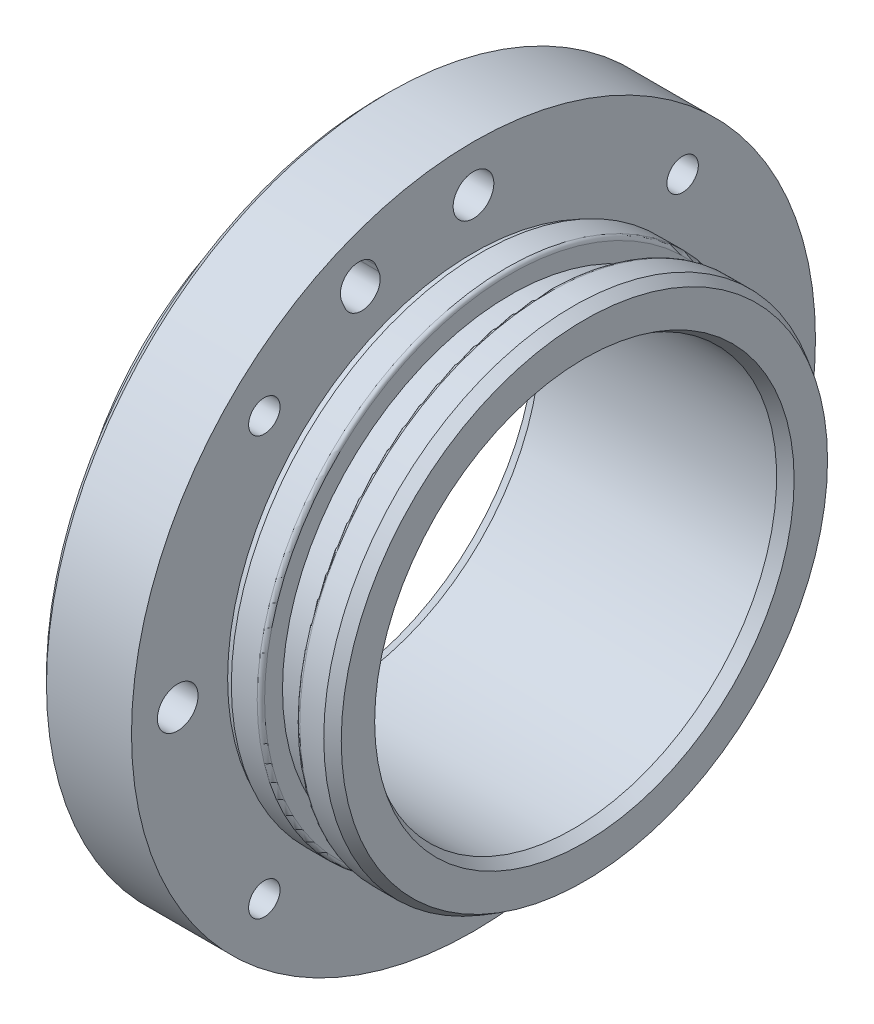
ISO-10303-21;
HEADER;
FILE_DESCRIPTION(('STEP AP214'),'2;1');
FILE_NAME('part.step','',(''),(''),'','','');
FILE_SCHEMA(('AUTOMOTIVE_DESIGN { 1 0 10303 214 1 1 1 1 }'));
ENDSEC;
DATA;
#1=APPLICATION_CONTEXT('core data for automotive mechanical design processes');
#2=APPLICATION_PROTOCOL_DEFINITION('international standard','automotive_design',2000,#1);
#3=PRODUCT_CONTEXT('',#1,'mechanical');
#4=PRODUCT('Part','Part','',(#3));
#5=PRODUCT_RELATED_PRODUCT_CATEGORY('part','',(#4));
#6=PRODUCT_DEFINITION_FORMATION('','',#4);
#7=PRODUCT_DEFINITION_CONTEXT('part definition',#1,'design');
#8=PRODUCT_DEFINITION('design','',#6,#7);
#9=PRODUCT_DEFINITION_SHAPE('','',#8);
#10=(LENGTH_UNIT() NAMED_UNIT(*) SI_UNIT(.MILLI.,.METRE.));
#11=(NAMED_UNIT(*) PLANE_ANGLE_UNIT() SI_UNIT($,.RADIAN.));
#12=(NAMED_UNIT(*) SI_UNIT($,.STERADIAN.) SOLID_ANGLE_UNIT());
#13=UNCERTAINTY_MEASURE_WITH_UNIT(LENGTH_MEASURE(1.E-05),#10,'distance_accuracy_value','');
#14=(GEOMETRIC_REPRESENTATION_CONTEXT(3) GLOBAL_UNCERTAINTY_ASSIGNED_CONTEXT((#13)) GLOBAL_UNIT_ASSIGNED_CONTEXT((#10,
#11,#12)) REPRESENTATION_CONTEXT('',''));
#15=CARTESIAN_POINT('',(0.,0.,0.));
#16=DIRECTION('',(0.,0.,1.));
#17=DIRECTION('',(1.,0.,0.));
#18=AXIS2_PLACEMENT_3D('',#15,#16,#17);
#19=CARTESIAN_POINT('',(-14.2354130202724,0.,0.));
#20=DIRECTION('',(-1.,0.,0.));
#21=DIRECTION('',(0.,0.,1.));
#22=AXIS2_PLACEMENT_3D('',#19,#20,#21);
#23=CYLINDRICAL_SURFACE('',#22,55.);
#24=CARTESIAN_POINT('',(-37.,0.,0.));
#25=DIRECTION('',(1.,0.,0.));
#26=DIRECTION('',(0.,0.,-1.));
#27=AXIS2_PLACEMENT_3D('',#24,#25,#26);
#28=CIRCLE('',#27,55.);
#29=CARTESIAN_POINT('',(-37.,0.,-55.));
#30=VERTEX_POINT('',#29);
#31=EDGE_CURVE('E601',#30,#30,#28,.F.);
#32=ORIENTED_EDGE('',*,*,#31,.T.);
#33=EDGE_LOOP('',(#32));
#34=FACE_BOUND('',#33,.T.);
#35=CARTESIAN_POINT('',(27.,0.,0.));
#36=DIRECTION('',(-1.,0.,0.));
#37=DIRECTION('',(0.,0.,1.));
#38=AXIS2_PLACEMENT_3D('',#35,#36,#37);
#39=CIRCLE('',#38,55.);
#40=CARTESIAN_POINT('',(27.,0.,55.));
#41=VERTEX_POINT('',#40);
#42=EDGE_CURVE('E568',#41,#41,#39,.F.);
#43=ORIENTED_EDGE('',*,*,#42,.T.);
#44=EDGE_LOOP('',(#43));
#45=FACE_BOUND('',#44,.T.);
#46=CARTESIAN_POINT('',(-12.5,24.126017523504,-49.4260586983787));
#47=CARTESIAN_POINT('',(-12.6893836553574,24.1260103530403,-49.4260631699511));
#48=CARTESIAN_POINT('',(-12.8789000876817,24.1116199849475,-49.4330945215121));
#49=CARTESIAN_POINT('',(-13.2527004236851,24.0543890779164,-49.4609678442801));
#50=CARTESIAN_POINT('',(-13.4369779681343,24.0115153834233,-49.4818259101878));
#51=CARTESIAN_POINT('',(-13.7948318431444,23.8984605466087,-49.5365269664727));
#52=CARTESIAN_POINT('',(-13.9684137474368,23.8282937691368,-49.5703631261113));
#53=CARTESIAN_POINT('',(-14.3000133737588,23.6625255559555,-49.6497058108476));
#54=CARTESIAN_POINT('',(-14.4580346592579,23.5669299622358,-49.695209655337));
#55=CARTESIAN_POINT('',(-14.7543027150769,23.3526892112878,-49.7962439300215));
#56=CARTESIAN_POINT('',(-14.8925238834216,23.2340146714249,-49.8517871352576));
#57=CARTESIAN_POINT('',(-15.1450490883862,22.9768533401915,-49.9708339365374));
#58=CARTESIAN_POINT('',(-15.2593521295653,22.8383657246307,-50.03433786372));
#59=CARTESIAN_POINT('',(-15.4608739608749,22.5451960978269,-50.1671207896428));
#60=CARTESIAN_POINT('',(-15.548071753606,22.3905016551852,-50.2364042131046));
#61=CARTESIAN_POINT('',(-15.6927733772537,22.0692375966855,-50.378364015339));
#62=CARTESIAN_POINT('',(-15.7502775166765,21.9026681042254,-50.4510403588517));
#63=CARTESIAN_POINT('',(-15.8338889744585,21.5624974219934,-50.597360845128));
#64=CARTESIAN_POINT('',(-15.8600361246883,21.3889054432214,-50.6710036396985));
#65=CARTESIAN_POINT('',(-15.8803143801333,21.0393794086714,-50.8171269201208));
#66=CARTESIAN_POINT('',(-15.8744458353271,20.8634453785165,-50.8896074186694));
#67=CARTESIAN_POINT('',(-15.8308921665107,20.5144910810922,-51.031275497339));
#68=CARTESIAN_POINT('',(-15.793249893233,20.3414672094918,-51.1004673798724));
#69=CARTESIAN_POINT('',(-15.6872837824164,20.0030674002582,-51.2338793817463));
#70=CARTESIAN_POINT('',(-15.61895976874,19.8376915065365,-51.2980994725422));
#71=CARTESIAN_POINT('',(-15.4535210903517,19.5192806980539,-51.4201011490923));
#72=CARTESIAN_POINT('',(-15.356386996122,19.3662542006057,-51.4778783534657));
#73=CARTESIAN_POINT('',(-15.1360995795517,19.0771483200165,-51.5857175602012));
#74=CARTESIAN_POINT('',(-15.0129459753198,18.9410691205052,-51.6357794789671));
#75=CARTESIAN_POINT('',(-14.743873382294,18.6896728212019,-51.7273051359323));
#76=CARTESIAN_POINT('',(-14.5979172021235,18.5743903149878,-51.7687545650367));
#77=CARTESIAN_POINT('',(-14.287512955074,18.3683181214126,-51.8422308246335));
#78=CARTESIAN_POINT('',(-14.123064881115,18.2775284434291,-51.8742576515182));
#79=CARTESIAN_POINT('',(-13.7803212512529,18.1231883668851,-51.9283811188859));
#80=CARTESIAN_POINT('',(-13.6020249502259,18.0596394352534,-51.9504772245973));
#81=CARTESIAN_POINT('',(-13.2366568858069,17.9617356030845,-51.9844088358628));
#82=CARTESIAN_POINT('',(-13.0495852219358,17.9273803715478,-51.9962444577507));
#83=CARTESIAN_POINT('',(-12.6723032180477,17.8889550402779,-52.0094771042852));
#84=CARTESIAN_POINT('',(-12.4820984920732,17.884835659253,-52.0108911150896));
#85=CARTESIAN_POINT('',(-12.1036625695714,17.9068789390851,-52.0033058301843));
#86=CARTESIAN_POINT('',(-11.9154313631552,17.9330414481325,-51.9943065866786));
#87=CARTESIAN_POINT('',(-11.546432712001,18.0148100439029,-51.9660318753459));
#88=CARTESIAN_POINT('',(-11.3656596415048,18.0703934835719,-51.9467643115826));
#89=CARTESIAN_POINT('',(-11.0165351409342,18.2092913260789,-51.8982378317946));
#90=CARTESIAN_POINT('',(-10.8481838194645,18.2926059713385,-51.8689788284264));
#91=CARTESIAN_POINT('',(-10.528442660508,18.4845705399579,-51.8008783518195));
#92=CARTESIAN_POINT('',(-10.3770750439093,18.5932530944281,-51.7620245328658));
#93=CARTESIAN_POINT('',(-10.0958218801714,18.8326362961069,-51.6754097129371));
#94=CARTESIAN_POINT('',(-9.96593653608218,18.9633371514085,-51.6276486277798));
#95=CARTESIAN_POINT('',(-9.73115923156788,19.2430671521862,-51.5240390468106));
#96=CARTESIAN_POINT('',(-9.62630093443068,19.3921205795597,-51.4681798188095));
#97=CARTESIAN_POINT('',(-9.44478460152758,19.7040225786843,-51.349579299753));
#98=CARTESIAN_POINT('',(-9.36812639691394,19.8668710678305,-51.2868380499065));
#99=CARTESIAN_POINT('',(-9.24524487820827,20.2014844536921,-51.1559600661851));
#100=CARTESIAN_POINT('',(-9.199000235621,20.3732430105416,-51.0878271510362));
#101=CARTESIAN_POINT('',(-9.13818875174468,20.7208069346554,-50.9478482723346));
#102=CARTESIAN_POINT('',(-9.12362161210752,20.8966122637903,-50.8760023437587));
#103=CARTESIAN_POINT('',(-9.12658152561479,21.2469423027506,-50.7306943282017));
#104=CARTESIAN_POINT('',(-9.1440558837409,21.4214686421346,-50.6572350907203));
#105=CARTESIAN_POINT('',(-9.21049353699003,21.764611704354,-50.5107562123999));
#106=CARTESIAN_POINT('',(-9.25945688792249,21.9332284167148,-50.4377365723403));
#107=CARTESIAN_POINT('',(-9.38747085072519,22.2598677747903,-50.2944343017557));
#108=CARTESIAN_POINT('',(-9.46652130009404,22.4178904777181,-50.2241516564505));
#109=CARTESIAN_POINT('',(-9.65245802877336,22.7190207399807,-50.0886553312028));
#110=CARTESIAN_POINT('',(-9.7593435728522,22.8621286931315,-50.0234415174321));
#111=CARTESIAN_POINT('',(-9.9981106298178,23.1297861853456,-49.9002481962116));
#112=CARTESIAN_POINT('',(-10.1300301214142,23.2543070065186,-49.8422799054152));
#113=CARTESIAN_POINT('',(-10.4150715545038,23.4812290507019,-49.7357782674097));
#114=CARTESIAN_POINT('',(-10.5681986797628,23.583624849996,-49.6872472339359));
#115=CARTESIAN_POINT('',(-10.8914782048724,23.7636453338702,-49.601402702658));
#116=CARTESIAN_POINT('',(-11.0616510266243,23.8412398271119,-49.5641028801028));
#117=CARTESIAN_POINT('',(-11.4139192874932,23.9693579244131,-49.502272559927));
#118=CARTESIAN_POINT('',(-11.5960004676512,24.0199132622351,-49.4777270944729));
#119=CARTESIAN_POINT('',(-11.8993311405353,24.0794768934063,-49.4487553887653));
#120=CARTESIAN_POINT('',(-12.0186194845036,24.0969085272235,-49.4402585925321));
#121=CARTESIAN_POINT('',(-12.2585872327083,24.1201811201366,-49.4289088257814));
#122=CARTESIAN_POINT('',(-12.3792666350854,24.1260220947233,-49.426055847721));
#123=CARTESIAN_POINT('',(-12.5,24.126017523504,-49.4260586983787));
#124=B_SPLINE_CURVE_WITH_KNOTS('',3,(#46,#47,#48,#49,#50,#51,#52,#53,#54,#55,#56,#57,#58,#59,
#60,#61,#62,#63,#64,#65,#66,#67,#68,#69,#70,#71,#72,#73,#74,#75,#76,#77,#78,#79,#80,#81,#82,#83,
#84,#85,#86,#87,#88,#89,#90,#91,#92,#93,#94,#95,#96,#97,#98,#99,#100,#101,#102,#103,#104,#105,
#106,#107,#108,#109,#110,#111,#112,#113,#114,#115,#116,#117,#118,#119,#120,#121,#122,#123),
.UNSPECIFIED.,.T.,.F.,(4,2,2,2,2,2,2,2,2,2,2,2,2,2,2,2,2,2,2,2,2,2,2,2,2,2,2,2,2,2,2,2,2,2,2,2,
2,2,4),(0.,0.567710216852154,1.13608242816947,1.70415589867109,2.27209897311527,
2.84076990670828,3.40946450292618,3.97859855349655,4.54772669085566,5.11613111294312,
5.68452932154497,6.25216219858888,6.81979833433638,7.38781815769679,7.95584413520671,
8.52480643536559,9.0937689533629,9.66276210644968,10.2317488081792,10.7998079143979,
11.3678641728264,11.9354837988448,12.50310838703,13.0714671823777,13.639831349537,
14.2089557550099,14.7780767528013,15.3467982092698,15.915514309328,16.4832959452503,
17.0510785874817,17.6188581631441,18.1866227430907,18.755255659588,19.3240278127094,
19.8934897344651,20.4622818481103,20.8242014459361,21.1861205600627),.UNSPECIFIED.);
#125=CARTESIAN_POINT('',(-12.5,24.126017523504,-49.4260586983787));
#126=VERTEX_POINT('',#125);
#127=EDGE_CURVE('E538',#126,#126,#124,.T.);
#128=ORIENTED_EDGE('',*,*,#127,.F.);
#129=EDGE_LOOP('',(#128));
#130=FACE_BOUND('',#129,.T.);
#131=ADVANCED_FACE('F450',(#34,#45,#130),#23,.F.);
#132=CARTESIAN_POINT('',(-14.2354130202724,0.,0.));
#133=DIRECTION('',(-1.,0.,0.));
#134=DIRECTION('',(0.,0.,1.));
#135=AXIS2_PLACEMENT_3D('',#132,#133,#134);
#136=CYLINDRICAL_SURFACE('',#135,92.5);
#137=CARTESIAN_POINT('',(-23.,0.,0.));
#138=DIRECTION('',(1.,0.,0.));
#139=DIRECTION('',(0.,0.,-1.));
#140=AXIS2_PLACEMENT_3D('',#137,#138,#139);
#141=CIRCLE('',#140,92.5);
#142=CARTESIAN_POINT('',(-23.,0.,-92.5));
#143=VERTEX_POINT('',#142);
#144=EDGE_CURVE('E609',#143,#143,#141,.T.);
#145=ORIENTED_EDGE('',*,*,#144,.T.);
#146=EDGE_LOOP('',(#145));
#147=FACE_BOUND('',#146,.T.);
#148=CARTESIAN_POINT('',(0.,0.,0.));
#149=DIRECTION('',(-1.,0.,0.));
#150=DIRECTION('',(0.,0.,1.));
#151=AXIS2_PLACEMENT_3D('',#148,#149,#150);
#152=CIRCLE('',#151,92.5);
#153=CARTESIAN_POINT('',(0.,0.,92.5));
#154=VERTEX_POINT('',#153);
#155=EDGE_CURVE('E647',#154,#154,#152,.T.);
#156=ORIENTED_EDGE('',*,*,#155,.T.);
#157=EDGE_LOOP('',(#156));
#158=FACE_BOUND('',#157,.T.);
#159=CARTESIAN_POINT('',(-12.5,38.4927408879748,-84.1103970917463));
#160=CARTESIAN_POINT('',(-12.3104924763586,38.492733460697,-84.1104010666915));
#161=CARTESIAN_POINT('',(-12.1208491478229,38.4781704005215,-84.1170699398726));
#162=CARTESIAN_POINT('',(-11.7467900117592,38.4202613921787,-84.143535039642));
#163=CARTESIAN_POINT('',(-11.5623806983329,38.3768811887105,-84.1633468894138));
#164=CARTESIAN_POINT('',(-11.2042626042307,38.2625229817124,-84.2153979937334));
#165=CARTESIAN_POINT('',(-11.0305485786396,38.1915586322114,-84.2476310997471));
#166=CARTESIAN_POINT('',(-10.6987108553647,38.023981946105,-84.3233965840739));
#167=CARTESIAN_POINT('',(-10.5405833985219,37.9273758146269,-84.3669262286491));
#168=CARTESIAN_POINT('',(-10.2442634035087,37.7110860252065,-84.4638265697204));
#169=CARTESIAN_POINT('',(-10.1060812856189,37.5913903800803,-84.5172023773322));
#170=CARTESIAN_POINT('',(-9.85366263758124,37.3322280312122,-84.6319962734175));
#171=CARTESIAN_POINT('',(-9.73942706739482,37.1927605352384,-84.69341468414));
#172=CARTESIAN_POINT('',(-9.53812240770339,36.8978626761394,-84.8223059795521));
#173=CARTESIAN_POINT('',(-9.45106040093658,36.7424281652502,-84.8897804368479));
#174=CARTESIAN_POINT('',(-9.30662000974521,36.4199449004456,-85.0286328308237));
#175=CARTESIAN_POINT('',(-9.24924147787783,36.2528962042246,-85.1000107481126));
#176=CARTESIAN_POINT('',(-9.16582149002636,35.9119408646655,-85.2444528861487));
#177=CARTESIAN_POINT('',(-9.13976597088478,35.7380373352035,-85.3175163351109));
#178=CARTESIAN_POINT('',(-9.1196882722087,35.3882122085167,-85.4632104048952));
#179=CARTESIAN_POINT('',(-9.12566593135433,35.2122906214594,-85.5358410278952));
#180=CARTESIAN_POINT('',(-9.16947312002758,34.8635184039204,-85.6785888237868));
#181=CARTESIAN_POINT('',(-9.20728748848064,34.6906663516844,-85.7487071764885));
#182=CARTESIAN_POINT('',(-9.31367121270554,34.3528949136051,-85.8845840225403));
#183=CARTESIAN_POINT('',(-9.38224065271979,34.1879755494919,-85.9503425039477));
#184=CARTESIAN_POINT('',(-9.54820545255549,33.8707815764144,-86.0758345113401));
#185=CARTESIAN_POINT('',(-9.64560774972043,33.7185100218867,-86.135566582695));
#186=CARTESIAN_POINT('',(-9.86646825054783,33.4310678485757,-86.2475363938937));
#187=CARTESIAN_POINT('',(-9.98992654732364,33.295897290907,-86.2997741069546));
#188=CARTESIAN_POINT('',(-10.2594803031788,33.046523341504,-86.3955739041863));
#189=CARTESIAN_POINT('',(-10.4055889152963,32.9323322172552,-86.4391309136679));
#190=CARTESIAN_POINT('',(-10.7162494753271,32.7283654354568,-86.5165651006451));
#191=CARTESIAN_POINT('',(-10.8808014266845,32.6385897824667,-86.550442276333));
#192=CARTESIAN_POINT('',(-11.2236852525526,32.4861023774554,-86.607793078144));
#193=CARTESIAN_POINT('',(-11.4020173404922,32.4233910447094,-86.6312665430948));
#194=CARTESIAN_POINT('',(-11.7673957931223,32.3268952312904,-86.6673209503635));
#195=CARTESIAN_POINT('',(-11.9544421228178,32.2931106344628,-86.6799019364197));
#196=CARTESIAN_POINT('',(-12.3318239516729,32.2554848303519,-86.6939104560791));
#197=CARTESIAN_POINT('',(-12.5221574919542,32.2516263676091,-86.6953444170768));
#198=CARTESIAN_POINT('',(-12.9008123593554,32.273922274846,-86.6870467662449));
#199=CARTESIAN_POINT('',(-13.0891336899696,32.3000765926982,-86.6773151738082));
#200=CARTESIAN_POINT('',(-13.4583669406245,32.3816084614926,-86.6468886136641));
#201=CARTESIAN_POINT('',(-13.6392808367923,32.4369781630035,-86.6261965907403));
#202=CARTESIAN_POINT('',(-13.9886244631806,32.5752942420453,-86.574278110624));
#203=CARTESIAN_POINT('',(-14.1570541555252,32.6582407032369,-86.5430516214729));
#204=CARTESIAN_POINT('',(-14.4767330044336,32.8493067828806,-86.4707085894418));
#205=CARTESIAN_POINT('',(-14.6279742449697,32.95743793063,-86.4295875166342));
#206=CARTESIAN_POINT('',(-14.9089034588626,33.1956774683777,-86.3383647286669));
#207=CARTESIAN_POINT('',(-15.0385913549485,33.3257859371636,-86.2882629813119));
#208=CARTESIAN_POINT('',(-15.2727940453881,33.6042473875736,-86.1801997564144));
#209=CARTESIAN_POINT('',(-15.3772969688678,33.7526089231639,-86.1222345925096));
#210=CARTESIAN_POINT('',(-15.5580821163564,34.0632165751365,-85.9998552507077));
#211=CARTESIAN_POINT('',(-15.6343644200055,34.2254626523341,-85.9354410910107));
#212=CARTESIAN_POINT('',(-15.7565221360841,34.5591091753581,-85.801807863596));
#213=CARTESIAN_POINT('',(-15.802405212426,34.7305073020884,-85.7325900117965));
#214=CARTESIAN_POINT('',(-15.8624871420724,35.0775739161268,-85.5911730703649));
#215=CARTESIAN_POINT('',(-15.8766860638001,35.253242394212,-85.5189739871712));
#216=CARTESIAN_POINT('',(-15.8729957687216,35.6037369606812,-85.3736486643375));
#217=CARTESIAN_POINT('',(-15.8551252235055,35.7785634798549,-85.300522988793));
#218=CARTESIAN_POINT('',(-15.7878417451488,36.1225353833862,-85.1554302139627));
#219=CARTESIAN_POINT('',(-15.7384287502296,36.2916807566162,-85.0834631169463));
#220=CARTESIAN_POINT('',(-15.6094661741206,36.6195509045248,-84.9428651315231));
#221=CARTESIAN_POINT('',(-15.5299161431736,36.7782755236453,-84.874234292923));
#222=CARTESIAN_POINT('',(-15.3429424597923,37.080884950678,-84.7424642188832));
#223=CARTESIAN_POINT('',(-15.2355197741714,37.2247702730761,-84.6793247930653));
#224=CARTESIAN_POINT('',(-14.9957891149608,37.4938041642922,-84.5605482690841));
#225=CARTESIAN_POINT('',(-14.8634693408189,37.6189437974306,-84.5049147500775));
#226=CARTESIAN_POINT('',(-14.5776856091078,37.8470008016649,-84.4030223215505));
#227=CARTESIAN_POINT('',(-14.4242164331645,37.9499126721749,-84.3567657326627));
#228=CARTESIAN_POINT('',(-14.1004140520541,38.1307266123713,-84.2751895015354));
#229=CARTESIAN_POINT('',(-13.930068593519,38.2086103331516,-84.2398778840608));
#230=CARTESIAN_POINT('',(-13.5775661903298,38.3370701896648,-84.1814948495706));
#231=CARTESIAN_POINT('',(-13.3954235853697,38.3876788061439,-84.1584088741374));
#232=CARTESIAN_POINT('',(-13.0934461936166,38.4468420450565,-84.131390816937));
#233=CARTESIAN_POINT('',(-12.9755704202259,38.464033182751,-84.1235300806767));
#234=CARTESIAN_POINT('',(-12.7384810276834,38.486984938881,-84.1130319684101));
#235=CARTESIAN_POINT('',(-12.6192674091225,38.4927455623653,-84.1103945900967));
#236=CARTESIAN_POINT('',(-12.5,38.4927408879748,-84.1103970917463));
#237=B_SPLINE_CURVE_WITH_KNOTS('',3,(#159,#160,#161,#162,#163,#164,#165,#166,#167,#168,#169,
#170,#171,#172,#173,#174,#175,#176,#177,#178,#179,#180,#181,#182,#183,#184,#185,#186,#187,#188,
#189,#190,#191,#192,#193,#194,#195,#196,#197,#198,#199,#200,#201,#202,#203,#204,#205,#206,#207,
#208,#209,#210,#211,#212,#213,#214,#215,#216,#217,#218,#219,#220,#221,#222,#223,#224,#225,#226,
#227,#228,#229,#230,#231,#232,#233,#234,#235,#236),.UNSPECIFIED.,.T.,.F.,(4,2,2,2,2,2,2,2,2,2,2,
2,2,2,2,2,2,2,2,2,2,2,2,2,2,2,2,2,2,2,2,2,2,2,2,2,2,2,4),(0.,0.568087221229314,1.13685094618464,
1.70533349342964,2.27367859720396,2.84231956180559,3.41098331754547,3.9797951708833,
4.54860419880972,5.11715775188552,5.68570844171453,6.2539885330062,6.8222701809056,
7.39068867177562,7.9591091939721,8.52786104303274,9.0966129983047,9.66537376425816,
10.2341322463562,10.8025627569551,11.3709922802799,11.9392691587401,12.5075477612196,
13.0760870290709,13.6446283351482,14.2134370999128,14.7822442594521,15.3509079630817,
15.9195704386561,16.4879019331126,17.0562345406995,17.6245756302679,18.1928970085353,
18.7614884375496,19.3302204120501,19.8993683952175,20.4678370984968,20.8253654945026,
21.1828937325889),.UNSPECIFIED.);
#238=CARTESIAN_POINT('',(-12.5,38.4927408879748,-84.1103970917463));
#239=VERTEX_POINT('',#238);
#240=EDGE_CURVE('E560',#239,#239,#237,.T.);
#241=ORIENTED_EDGE('',*,*,#240,.F.);
#242=EDGE_LOOP('',(#241));
#243=FACE_BOUND('',#242,.T.);
#244=ADVANCED_FACE('F571',(#147,#158,#243),#136,.T.);
#245=CARTESIAN_POINT('',(-14.2354130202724,0.,0.));
#246=DIRECTION('',(-1.,0.,0.));
#247=DIRECTION('',(0.,0.,1.));
#248=AXIS2_PLACEMENT_3D('',#245,#246,#247);
#249=CYLINDRICAL_SURFACE('',#248,67.5);
#250=CARTESIAN_POINT('',(9.,0.,0.));
#251=DIRECTION('',(1.,0.,0.));
#252=DIRECTION('',(0.,0.,-1.));
#253=AXIS2_PLACEMENT_3D('',#250,#251,#252);
#254=CIRCLE('',#253,67.5);
#255=CARTESIAN_POINT('',(9.,0.,-67.5));
#256=VERTEX_POINT('',#255);
#257=EDGE_CURVE('E458',#256,#256,#254,.F.);
#258=ORIENTED_EDGE('',*,*,#257,.T.);
#259=EDGE_LOOP('',(#258));
#260=FACE_BOUND('',#259,.T.);
#261=CARTESIAN_POINT('',(2.,0.,0.));
#262=DIRECTION('',(-1.,0.,0.));
#263=DIRECTION('',(0.,0.,1.));
#264=AXIS2_PLACEMENT_3D('',#261,#262,#263);
#265=CIRCLE('',#264,67.5);
#266=CARTESIAN_POINT('',(2.,0.,67.5));
#267=VERTEX_POINT('',#266);
#268=EDGE_CURVE('E546',#267,#267,#265,.T.);
#269=ORIENTED_EDGE('',*,*,#268,.F.);
#270=EDGE_LOOP('',(#269));
#271=FACE_BOUND('',#270,.T.);
#272=ADVANCED_FACE('F576',(#260,#271),#249,.T.);
#273=CARTESIAN_POINT('',(20.5,0.,0.));
#274=DIRECTION('',(-1.,0.,0.));
#275=DIRECTION('',(0.,0.,1.));
#276=AXIS2_PLACEMENT_3D('',#273,#274,#275);
#277=CIRCLE('',#276,67.5);
#278=CARTESIAN_POINT('',(20.5,0.,67.5));
#279=VERTEX_POINT('',#278);
#280=EDGE_CURVE('E758',#279,#279,#277,.F.);
#281=ORIENTED_EDGE('',*,*,#280,.T.);
#282=EDGE_LOOP('',(#281));
#283=FACE_BOUND('',#282,.T.);
#284=CARTESIAN_POINT('',(27.,0.,0.));
#285=DIRECTION('',(-1.,0.,0.));
#286=DIRECTION('',(0.,0.,1.));
#287=AXIS2_PLACEMENT_3D('',#284,#285,#286);
#288=CIRCLE('',#287,67.5);
#289=CARTESIAN_POINT('',(27.,0.,67.5));
#290=VERTEX_POINT('',#289);
#291=EDGE_CURVE('E640',#290,#290,#288,.T.);
#292=ORIENTED_EDGE('',*,*,#291,.T.);
#293=EDGE_LOOP('',(#292));
#294=FACE_BOUND('',#293,.T.);
#295=ADVANCED_FACE('F583',(#283,#294),#249,.T.);
#296=CARTESIAN_POINT('',(30.,55.,0.));
#297=DIRECTION('',(-1.,0.,0.));
#298=DIRECTION('',(0.,0.,1.));
#299=AXIS2_PLACEMENT_3D('',#296,#297,#298);
#300=PLANE('',#299);
#301=CARTESIAN_POINT('',(30.,0.,0.));
#302=DIRECTION('',(-1.,0.,0.));
#303=DIRECTION('',(0.,0.,1.));
#304=AXIS2_PLACEMENT_3D('',#301,#302,#303);
#305=CIRCLE('',#304,56.7320508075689);
#306=CARTESIAN_POINT('',(30.,0.,56.7320508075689));
#307=VERTEX_POINT('',#306);
#308=EDGE_CURVE('E608',#307,#307,#305,.T.);
#309=ORIENTED_EDGE('',*,*,#308,.T.);
#310=EDGE_LOOP('',(#309));
#311=FACE_BOUND('',#310,.T.);
#312=CARTESIAN_POINT('',(30.,0.,0.));
#313=DIRECTION('',(-1.,0.,0.));
#314=DIRECTION('',(0.,0.,1.));
#315=AXIS2_PLACEMENT_3D('',#312,#313,#314);
#316=CIRCLE('',#315,65.7679491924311);
#317=CARTESIAN_POINT('',(30.,0.,65.7679491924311));
#318=VERTEX_POINT('',#317);
#319=EDGE_CURVE('E637',#318,#318,#316,.F.);
#320=ORIENTED_EDGE('',*,*,#319,.T.);
#321=EDGE_LOOP('',(#320));
#322=FACE_BOUND('',#321,.T.);
#323=ADVANCED_FACE('F582',(#311,#322),#300,.F.);
#324=CARTESIAN_POINT('',(0.,67.5,0.));
#325=DIRECTION('',(-1.,0.,0.));
#326=DIRECTION('',(0.,0.,1.));
#327=AXIS2_PLACEMENT_3D('',#324,#325,#326);
#328=PLANE('',#327);
#329=DIRECTION('',(0.,0.923879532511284,0.382683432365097));
#330=VECTOR('',#329,1.);
#331=CARTESIAN_POINT('',(0.,74.8999002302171,25.6125934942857));
#332=LINE('',#331,#330);
#333=CARTESIAN_POINT('',(0.,74.8999002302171,25.6125934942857));
#334=VERTEX_POINT('',#333);
#335=CARTESIAN_POINT('',(0.,76.7476592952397,26.3779603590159));
#336=VERTEX_POINT('',#335);
#337=EDGE_CURVE('E515',#334,#336,#332,.T.);
#338=ORIENTED_EDGE('',*,*,#337,.F.);
#339=CARTESIAN_POINT('',(0.,72.9864830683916,30.2319911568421));
#340=DIRECTION('',(1.,0.,0.));
#341=DIRECTION('',(0.,0.,-1.));
#342=AXIS2_PLACEMENT_3D('',#339,#340,#341);
#343=CIRCLE('',#342,5.00000000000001);
#344=CARTESIAN_POINT('',(0.,71.0730659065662,34.8513888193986));
#345=VERTEX_POINT('',#344);
#346=EDGE_CURVE('E465',#345,#334,#343,.T.);
#347=ORIENTED_EDGE('',*,*,#346,.F.);
#348=DIRECTION('',(0.,-0.923879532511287,-0.38268343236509));
#349=VECTOR('',#348,1.);
#350=CARTESIAN_POINT('',(0.,71.0730659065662,34.8513888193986));
#351=LINE('',#350,#349);
#352=CARTESIAN_POINT('',(0.,72.9208249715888,35.6167556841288));
#353=VERTEX_POINT('',#352);
#354=EDGE_CURVE('E522',#353,#345,#351,.T.);
#355=ORIENTED_EDGE('',*,*,#354,.F.);
#356=CARTESIAN_POINT('',(0.,74.8342421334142,30.9973580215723));
#357=DIRECTION('',(1.,0.,0.));
#358=DIRECTION('',(0.,0.,-1.));
#359=AXIS2_PLACEMENT_3D('',#356,#357,#358);
#360=CIRCLE('',#359,5.);
#361=EDGE_CURVE('E504',#336,#353,#360,.T.);
#362=ORIENTED_EDGE('',*,*,#361,.F.);
#363=EDGE_LOOP('',(#338,#347,#355,#362));
#364=FACE_BOUND('',#363,.T.);
#365=CARTESIAN_POINT('',(0.,-56.5685424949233,-56.5685424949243));
#366=DIRECTION('',(-1.,0.,0.));
#367=DIRECTION('',(0.,0.,1.));
#368=AXIS2_PLACEMENT_3D('',#365,#366,#367);
#369=CIRCLE('',#368,4.24999999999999);
#370=CARTESIAN_POINT('',(0.,-56.5685424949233,-52.3185424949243));
#371=VERTEX_POINT('',#370);
#372=EDGE_CURVE('E708',#371,#371,#369,.T.);
#373=ORIENTED_EDGE('',*,*,#372,.T.);
#374=EDGE_LOOP('',(#373));
#375=FACE_BOUND('',#374,.T.);
#376=CARTESIAN_POINT('',(0.,-56.5685424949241,56.5685424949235));
#377=DIRECTION('',(-1.,0.,0.));
#378=DIRECTION('',(0.,0.,1.));
#379=AXIS2_PLACEMENT_3D('',#376,#377,#378);
#380=CIRCLE('',#379,4.24999999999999);
#381=CARTESIAN_POINT('',(0.,-56.5685424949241,60.8185424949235));
#382=VERTEX_POINT('',#381);
#383=EDGE_CURVE('E702',#382,#382,#380,.T.);
#384=ORIENTED_EDGE('',*,*,#383,.T.);
#385=EDGE_LOOP('',(#384));
#386=FACE_BOUND('',#385,.T.);
#387=CARTESIAN_POINT('',(0.,56.5685424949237,56.5685424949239));
#388=DIRECTION('',(-1.,0.,0.));
#389=DIRECTION('',(0.,0.,1.));
#390=AXIS2_PLACEMENT_3D('',#387,#388,#389);
#391=CIRCLE('',#390,4.24999999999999);
#392=CARTESIAN_POINT('',(0.,56.5685424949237,60.8185424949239));
#393=VERTEX_POINT('',#392);
#394=EDGE_CURVE('E696',#393,#393,#391,.T.);
#395=ORIENTED_EDGE('',*,*,#394,.T.);
#396=EDGE_LOOP('',(#395));
#397=FACE_BOUND('',#396,.T.);
#398=CARTESIAN_POINT('',(0.,8.37956006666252E-13,-80.));
#399=DIRECTION('',(-1.,0.,0.));
#400=DIRECTION('',(0.,0.,1.));
#401=AXIS2_PLACEMENT_3D('',#398,#399,#400);
#402=CIRCLE('',#401,5.49999999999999);
#403=CARTESIAN_POINT('',(0.,8.37956006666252E-13,-74.5));
#404=VERTEX_POINT('',#403);
#405=EDGE_CURVE('E615',#404,#404,#402,.T.);
#406=ORIENTED_EDGE('',*,*,#405,.T.);
#407=EDGE_LOOP('',(#406));
#408=FACE_BOUND('',#407,.T.);
#409=CARTESIAN_POINT('',(0.,-80.,-5.58637337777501E-13));
#410=DIRECTION('',(-1.,0.,0.));
#411=DIRECTION('',(0.,0.,1.));
#412=AXIS2_PLACEMENT_3D('',#409,#410,#411);
#413=CIRCLE('',#412,5.5);
#414=CARTESIAN_POINT('',(0.,-80.,5.49999999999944));
#415=VERTEX_POINT('',#414);
#416=EDGE_CURVE('E620',#415,#415,#413,.T.);
#417=ORIENTED_EDGE('',*,*,#416,.T.);
#418=EDGE_LOOP('',(#417));
#419=FACE_BOUND('',#418,.T.);
#420=CARTESIAN_POINT('',(0.,-2.79318668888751E-13,80.));
#421=DIRECTION('',(-1.,0.,0.));
#422=DIRECTION('',(0.,0.,1.));
#423=AXIS2_PLACEMENT_3D('',#420,#421,#422);
#424=CIRCLE('',#423,5.49999999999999);
#425=CARTESIAN_POINT('',(0.,-2.79318668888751E-13,85.5));
#426=VERTEX_POINT('',#425);
#427=EDGE_CURVE('E625',#426,#426,#424,.T.);
#428=ORIENTED_EDGE('',*,*,#427,.T.);
#429=EDGE_LOOP('',(#428));
#430=FACE_BOUND('',#429,.T.);
#431=CARTESIAN_POINT('',(0.,56.5685424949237,-56.5685424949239));
#432=DIRECTION('',(-1.,0.,0.));
#433=DIRECTION('',(0.,0.,1.));
#434=AXIS2_PLACEMENT_3D('',#431,#432,#433);
#435=CIRCLE('',#434,4.24999999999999);
#436=CARTESIAN_POINT('',(0.,56.5685424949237,-52.3185424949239));
#437=VERTEX_POINT('',#436);
#438=EDGE_CURVE('E663',#437,#437,#435,.T.);
#439=ORIENTED_EDGE('',*,*,#438,.T.);
#440=EDGE_LOOP('',(#439));
#441=FACE_BOUND('',#440,.T.);
#442=CARTESIAN_POINT('',(0.,80.,0.));
#443=DIRECTION('',(-1.,0.,0.));
#444=DIRECTION('',(0.,0.,1.));
#445=AXIS2_PLACEMENT_3D('',#442,#443,#444);
#446=CIRCLE('',#445,5.5);
#447=CARTESIAN_POINT('',(0.,80.,5.5));
#448=VERTEX_POINT('',#447);
#449=EDGE_CURVE('E630',#448,#448,#446,.T.);
#450=ORIENTED_EDGE('',*,*,#449,.T.);
#451=EDGE_LOOP('',(#450));
#452=FACE_BOUND('',#451,.T.);
#453=ORIENTED_EDGE('',*,*,#155,.F.);
#454=EDGE_LOOP('',(#453));
#455=FACE_BOUND('',#454,.T.);
#456=CARTESIAN_POINT('',(0.,0.,0.));
#457=DIRECTION('',(-1.,0.,0.));
#458=DIRECTION('',(0.,0.,1.));
#459=AXIS2_PLACEMENT_3D('',#456,#457,#458);
#460=CIRCLE('',#459,66.5);
#461=CARTESIAN_POINT('',(0.,0.,66.5));
#462=VERTEX_POINT('',#461);
#463=EDGE_CURVE('E738',#462,#462,#460,.T.);
#464=ORIENTED_EDGE('',*,*,#463,.T.);
#465=EDGE_LOOP('',(#464));
#466=FACE_BOUND('',#465,.T.);
#467=ADVANCED_FACE('F519',(#364,#375,#386,#397,#408,#419,#430,#441,#452,#455,#466),#328,.F.);
#468=CARTESIAN_POINT('',(-25.,92.5,0.));
#469=DIRECTION('',(1.,0.,0.));
#470=DIRECTION('',(0.,0.,-1.));
#471=AXIS2_PLACEMENT_3D('',#468,#469,#470);
#472=PLANE('',#471);
#473=CARTESIAN_POINT('',(-25.,-56.5685424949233,-56.5685424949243));
#474=DIRECTION('',(-1.,0.,0.));
#475=DIRECTION('',(0.,0.,1.));
#476=AXIS2_PLACEMENT_3D('',#473,#474,#475);
#477=CIRCLE('',#476,4.24999999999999);
#478=CARTESIAN_POINT('',(-25.,-56.5685424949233,-52.3185424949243));
#479=VERTEX_POINT('',#478);
#480=EDGE_CURVE('E711',#479,#479,#477,.T.);
#481=ORIENTED_EDGE('',*,*,#480,.F.);
#482=EDGE_LOOP('',(#481));
#483=FACE_BOUND('',#482,.T.);
#484=CARTESIAN_POINT('',(-25.,-56.5685424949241,56.5685424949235));
#485=DIRECTION('',(-1.,0.,0.));
#486=DIRECTION('',(0.,0.,1.));
#487=AXIS2_PLACEMENT_3D('',#484,#485,#486);
#488=CIRCLE('',#487,4.24999999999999);
#489=CARTESIAN_POINT('',(-25.,-56.5685424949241,60.8185424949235));
#490=VERTEX_POINT('',#489);
#491=EDGE_CURVE('E705',#490,#490,#488,.T.);
#492=ORIENTED_EDGE('',*,*,#491,.F.);
#493=EDGE_LOOP('',(#492));
#494=FACE_BOUND('',#493,.T.);
#495=CARTESIAN_POINT('',(-25.,56.5685424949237,56.5685424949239));
#496=DIRECTION('',(-1.,0.,0.));
#497=DIRECTION('',(0.,0.,1.));
#498=AXIS2_PLACEMENT_3D('',#495,#496,#497);
#499=CIRCLE('',#498,4.24999999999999);
#500=CARTESIAN_POINT('',(-25.,56.5685424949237,60.8185424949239));
#501=VERTEX_POINT('',#500);
#502=EDGE_CURVE('E699',#501,#501,#499,.T.);
#503=ORIENTED_EDGE('',*,*,#502,.F.);
#504=EDGE_LOOP('',(#503));
#505=FACE_BOUND('',#504,.T.);
#506=CARTESIAN_POINT('',(-25.,8.37956006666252E-13,-80.));
#507=DIRECTION('',(-1.,0.,0.));
#508=DIRECTION('',(0.,0.,1.));
#509=AXIS2_PLACEMENT_3D('',#506,#507,#508);
#510=CIRCLE('',#509,8.5);
#511=CARTESIAN_POINT('',(-25.,8.37956006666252E-13,-71.5));
#512=VERTEX_POINT('',#511);
#513=EDGE_CURVE('E619',#512,#512,#510,.T.);
#514=ORIENTED_EDGE('',*,*,#513,.F.);
#515=EDGE_LOOP('',(#514));
#516=FACE_BOUND('',#515,.T.);
#517=CARTESIAN_POINT('',(-25.,-80.,-5.58637337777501E-13));
#518=DIRECTION('',(-1.,0.,0.));
#519=DIRECTION('',(0.,0.,1.));
#520=AXIS2_PLACEMENT_3D('',#517,#518,#519);
#521=CIRCLE('',#520,8.49999999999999);
#522=CARTESIAN_POINT('',(-25.,-80.,8.49999999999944));
#523=VERTEX_POINT('',#522);
#524=EDGE_CURVE('E624',#523,#523,#521,.T.);
#525=ORIENTED_EDGE('',*,*,#524,.F.);
#526=EDGE_LOOP('',(#525));
#527=FACE_BOUND('',#526,.T.);
#528=CARTESIAN_POINT('',(-25.,-2.79318668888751E-13,80.));
#529=DIRECTION('',(-1.,0.,0.));
#530=DIRECTION('',(0.,0.,1.));
#531=AXIS2_PLACEMENT_3D('',#528,#529,#530);
#532=CIRCLE('',#531,8.5);
#533=CARTESIAN_POINT('',(-25.,-2.79318668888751E-13,88.5));
#534=VERTEX_POINT('',#533);
#535=EDGE_CURVE('E629',#534,#534,#532,.T.);
#536=ORIENTED_EDGE('',*,*,#535,.F.);
#537=EDGE_LOOP('',(#536));
#538=FACE_BOUND('',#537,.T.);
#539=CARTESIAN_POINT('',(-25.,56.5685424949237,-56.5685424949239));
#540=DIRECTION('',(-1.,0.,0.));
#541=DIRECTION('',(0.,0.,1.));
#542=AXIS2_PLACEMENT_3D('',#539,#540,#541);
#543=CIRCLE('',#542,4.24999999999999);
#544=CARTESIAN_POINT('',(-25.,56.5685424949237,-52.3185424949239));
#545=VERTEX_POINT('',#544);
#546=EDGE_CURVE('E666',#545,#545,#543,.T.);
#547=ORIENTED_EDGE('',*,*,#546,.F.);
#548=EDGE_LOOP('',(#547));
#549=FACE_BOUND('',#548,.T.);
#550=CARTESIAN_POINT('',(-25.,80.,0.));
#551=DIRECTION('',(-1.,0.,0.));
#552=DIRECTION('',(0.,0.,1.));
#553=AXIS2_PLACEMENT_3D('',#550,#551,#552);
#554=CIRCLE('',#553,8.49999999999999);
#555=CARTESIAN_POINT('',(-25.,80.,8.49999999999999));
#556=VERTEX_POINT('',#555);
#557=EDGE_CURVE('E633',#556,#556,#554,.T.);
#558=ORIENTED_EDGE('',*,*,#557,.F.);
#559=EDGE_LOOP('',(#558));
#560=FACE_BOUND('',#559,.T.);
#561=CARTESIAN_POINT('',(-25.,0.,0.));
#562=DIRECTION('',(1.,0.,0.));
#563=DIRECTION('',(0.,0.,-1.));
#564=AXIS2_PLACEMENT_3D('',#561,#562,#563);
#565=CIRCLE('',#564,90.5);
#566=CARTESIAN_POINT('',(-25.,0.,-90.5));
#567=VERTEX_POINT('',#566);
#568=EDGE_CURVE('E612',#567,#567,#565,.F.);
#569=ORIENTED_EDGE('',*,*,#568,.T.);
#570=EDGE_LOOP('',(#569));
#571=FACE_BOUND('',#570,.T.);
#572=CARTESIAN_POINT('',(-25.,0.,0.));
#573=DIRECTION('',(-1.,0.,0.));
#574=DIRECTION('',(0.,0.,1.));
#575=AXIS2_PLACEMENT_3D('',#572,#573,#574);
#576=CIRCLE('',#575,70.);
#577=CARTESIAN_POINT('',(-25.,0.,70.));
#578=VERTEX_POINT('',#577);
#579=EDGE_CURVE('E650',#578,#578,#576,.T.);
#580=ORIENTED_EDGE('',*,*,#579,.F.);
#581=EDGE_LOOP('',(#580));
#582=FACE_BOUND('',#581,.T.);
#583=ADVANCED_FACE('F578',(#483,#494,#505,#516,#527,#538,#549,#560,#571,#582),#472,.F.);
#584=CARTESIAN_POINT('',(-14.2354130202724,0.,0.));
#585=DIRECTION('',(-1.,0.,0.));
#586=DIRECTION('',(0.,0.,1.));
#587=AXIS2_PLACEMENT_3D('',#584,#585,#586);
#588=CYLINDRICAL_SURFACE('',#587,70.);
#589=CARTESIAN_POINT('',(-40.,0.,0.));
#590=DIRECTION('',(-1.,0.,0.));
#591=DIRECTION('',(0.,0.,1.));
#592=AXIS2_PLACEMENT_3D('',#589,#590,#591);
#593=CIRCLE('',#592,70.);
#594=CARTESIAN_POINT('',(-40.,0.,70.));
#595=VERTEX_POINT('',#594);
#596=EDGE_CURVE('E632',#595,#595,#593,.T.);
#597=ORIENTED_EDGE('',*,*,#596,.F.);
#598=EDGE_LOOP('',(#597));
#599=FACE_BOUND('',#598,.T.);
#600=ORIENTED_EDGE('',*,*,#579,.T.);
#601=EDGE_LOOP('',(#600));
#602=FACE_BOUND('',#601,.T.);
#603=ADVANCED_FACE('F1099',(#599,#602),#588,.T.);
#604=CARTESIAN_POINT('',(-40.,70.,0.));
#605=DIRECTION('',(1.,0.,0.));
#606=DIRECTION('',(0.,0.,-1.));
#607=AXIS2_PLACEMENT_3D('',#604,#605,#606);
#608=PLANE('',#607);
#609=CARTESIAN_POINT('',(-40.,6.54653130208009E-13,-62.5));
#610=DIRECTION('',(-1.,0.,0.));
#611=DIRECTION('',(0.,0.,1.));
#612=AXIS2_PLACEMENT_3D('',#609,#610,#611);
#613=CIRCLE('',#612,3.4);
#614=CARTESIAN_POINT('',(-40.,6.54653130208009E-13,-59.1));
#615=VERTEX_POINT('',#614);
#616=EDGE_CURVE('E726',#615,#615,#613,.T.);
#617=ORIENTED_EDGE('',*,*,#616,.F.);
#618=EDGE_LOOP('',(#617));
#619=FACE_BOUND('',#618,.T.);
#620=CARTESIAN_POINT('',(-40.,-62.5,-4.36435420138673E-13));
#621=DIRECTION('',(-1.,0.,0.));
#622=DIRECTION('',(0.,0.,1.));
#623=AXIS2_PLACEMENT_3D('',#620,#621,#622);
#624=CIRCLE('',#623,3.4);
#625=CARTESIAN_POINT('',(-40.,-62.5,3.39999999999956));
#626=VERTEX_POINT('',#625);
#627=EDGE_CURVE('E720',#626,#626,#624,.T.);
#628=ORIENTED_EDGE('',*,*,#627,.F.);
#629=EDGE_LOOP('',(#628));
#630=FACE_BOUND('',#629,.T.);
#631=CARTESIAN_POINT('',(-40.,-2.18217710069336E-13,62.5));
#632=DIRECTION('',(-1.,0.,0.));
#633=DIRECTION('',(0.,0.,1.));
#634=AXIS2_PLACEMENT_3D('',#631,#632,#633);
#635=CIRCLE('',#634,3.4);
#636=CARTESIAN_POINT('',(-40.,-2.18217710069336E-13,65.9));
#637=VERTEX_POINT('',#636);
#638=EDGE_CURVE('E714',#637,#637,#635,.T.);
#639=ORIENTED_EDGE('',*,*,#638,.F.);
#640=EDGE_LOOP('',(#639));
#641=FACE_BOUND('',#640,.T.);
#642=CARTESIAN_POINT('',(-40.,62.5,0.));
#643=DIRECTION('',(-1.,0.,0.));
#644=DIRECTION('',(0.,0.,1.));
#645=AXIS2_PLACEMENT_3D('',#642,#643,#644);
#646=CIRCLE('',#645,3.4);
#647=CARTESIAN_POINT('',(-40.,62.5,3.4));
#648=VERTEX_POINT('',#647);
#649=EDGE_CURVE('E669',#648,#648,#646,.T.);
#650=ORIENTED_EDGE('',*,*,#649,.F.);
#651=EDGE_LOOP('',(#650));
#652=FACE_BOUND('',#651,.T.);
#653=CARTESIAN_POINT('',(-40.,0.,0.));
#654=DIRECTION('',(1.,0.,0.));
#655=DIRECTION('',(0.,0.,-1.));
#656=AXIS2_PLACEMENT_3D('',#653,#654,#655);
#657=CIRCLE('',#656,56.7320508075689);
#658=CARTESIAN_POINT('',(-40.,0.,-56.7320508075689));
#659=VERTEX_POINT('',#658);
#660=EDGE_CURVE('E643',#659,#659,#657,.T.);
#661=ORIENTED_EDGE('',*,*,#660,.T.);
#662=EDGE_LOOP('',(#661));
#663=FACE_BOUND('',#662,.T.);
#664=ORIENTED_EDGE('',*,*,#596,.T.);
#665=EDGE_LOOP('',(#664));
#666=FACE_BOUND('',#665,.T.);
#667=ADVANCED_FACE('F1091',(#619,#630,#641,#652,#663,#666),#608,.F.);
#668=CARTESIAN_POINT('',(-37.,0.,0.));
#669=DIRECTION('',(-1.,0.,0.));
#670=DIRECTION('',(0.,0.,1.));
#671=AXIS2_PLACEMENT_3D('',#668,#669,#670);
#672=CONICAL_SURFACE('',#671,55.,0.523598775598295);
#673=ORIENTED_EDGE('',*,*,#660,.F.);
#674=EDGE_LOOP('',(#673));
#675=FACE_BOUND('',#674,.T.);
#676=ORIENTED_EDGE('',*,*,#31,.F.);
#677=EDGE_LOOP('',(#676));
#678=FACE_BOUND('',#677,.T.);
#679=ADVANCED_FACE('F1083',(#675,#678),#672,.F.);
#680=CARTESIAN_POINT('',(27.,0.,0.));
#681=DIRECTION('',(-1.,0.,0.));
#682=DIRECTION('',(0.,0.,1.));
#683=AXIS2_PLACEMENT_3D('',#680,#681,#682);
#684=CONICAL_SURFACE('',#683,67.5,0.523598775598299);
#685=ORIENTED_EDGE('',*,*,#319,.F.);
#686=EDGE_LOOP('',(#685));
#687=FACE_BOUND('',#686,.T.);
#688=ORIENTED_EDGE('',*,*,#291,.F.);
#689=EDGE_LOOP('',(#688));
#690=FACE_BOUND('',#689,.T.);
#691=ADVANCED_FACE('F1075',(#687,#690),#684,.T.);
#692=CARTESIAN_POINT('',(-25.,0.,0.));
#693=DIRECTION('',(1.,0.,0.));
#694=DIRECTION('',(0.,0.,-1.));
#695=AXIS2_PLACEMENT_3D('',#692,#693,#694);
#696=CONICAL_SURFACE('',#695,90.5,0.785398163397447);
#697=ORIENTED_EDGE('',*,*,#144,.F.);
#698=EDGE_LOOP('',(#697));
#699=FACE_BOUND('',#698,.T.);
#700=ORIENTED_EDGE('',*,*,#568,.F.);
#701=EDGE_LOOP('',(#700));
#702=FACE_BOUND('',#701,.T.);
#703=ADVANCED_FACE('F1067',(#699,#702),#696,.T.);
#704=CARTESIAN_POINT('',(-25.,80.,0.));
#705=DIRECTION('',(-1.,0.,0.));
#706=DIRECTION('',(0.,0.,1.));
#707=AXIS2_PLACEMENT_3D('',#704,#705,#706);
#708=CYLINDRICAL_SURFACE('',#707,5.5);
#709=CARTESIAN_POINT('',(-14.,80.,0.));
#710=DIRECTION('',(-1.,0.,0.));
#711=DIRECTION('',(0.,0.,1.));
#712=AXIS2_PLACEMENT_3D('',#709,#710,#711);
#713=CIRCLE('',#712,5.50000000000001);
#714=CARTESIAN_POINT('',(-14.,80.,5.50000000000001));
#715=VERTEX_POINT('',#714);
#716=EDGE_CURVE('E660',#715,#715,#713,.T.);
#717=ORIENTED_EDGE('',*,*,#716,.T.);
#718=EDGE_LOOP('',(#717));
#719=FACE_BOUND('',#718,.T.);
#720=ORIENTED_EDGE('',*,*,#449,.F.);
#721=EDGE_LOOP('',(#720));
#722=FACE_BOUND('',#721,.T.);
#723=ADVANCED_FACE('F1059',(#719,#722),#708,.F.);
#724=CARTESIAN_POINT('',(-25.,80.,0.));
#725=DIRECTION('',(-1.,0.,0.));
#726=DIRECTION('',(0.,0.,1.));
#727=AXIS2_PLACEMENT_3D('',#724,#725,#726);
#728=CYLINDRICAL_SURFACE('',#727,8.49999999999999);
#729=CARTESIAN_POINT('',(-14.,80.,0.));
#730=DIRECTION('',(-1.,0.,0.));
#731=DIRECTION('',(0.,0.,1.));
#732=AXIS2_PLACEMENT_3D('',#729,#730,#731);
#733=CIRCLE('',#732,8.49999999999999);
#734=CARTESIAN_POINT('',(-14.,80.,8.49999999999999));
#735=VERTEX_POINT('',#734);
#736=EDGE_CURVE('E657',#735,#735,#733,.T.);
#737=ORIENTED_EDGE('',*,*,#736,.F.);
#738=EDGE_LOOP('',(#737));
#739=FACE_BOUND('',#738,.T.);
#740=ORIENTED_EDGE('',*,*,#557,.T.);
#741=EDGE_LOOP('',(#740));
#742=FACE_BOUND('',#741,.T.);
#743=ADVANCED_FACE('F1051',(#739,#742),#728,.F.);
#744=CARTESIAN_POINT('',(-14.,85.5,0.));
#745=DIRECTION('',(1.,0.,0.));
#746=DIRECTION('',(0.,0.,-1.));
#747=AXIS2_PLACEMENT_3D('',#744,#745,#746);
#748=PLANE('',#747);
#749=ORIENTED_EDGE('',*,*,#716,.F.);
#750=EDGE_LOOP('',(#749));
#751=FACE_BOUND('',#750,.T.);
#752=ORIENTED_EDGE('',*,*,#736,.T.);
#753=EDGE_LOOP('',(#752));
#754=FACE_BOUND('',#753,.T.);
#755=ADVANCED_FACE('F1043',(#751,#754),#748,.F.);
#756=CARTESIAN_POINT('',(-25.,56.5685424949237,-56.5685424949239));
#757=DIRECTION('',(-1.,0.,0.));
#758=DIRECTION('',(0.,0.,1.));
#759=AXIS2_PLACEMENT_3D('',#756,#757,#758);
#760=CYLINDRICAL_SURFACE('',#759,4.24999999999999);
#761=ORIENTED_EDGE('',*,*,#546,.T.);
#762=EDGE_LOOP('',(#761));
#763=FACE_BOUND('',#762,.T.);
#764=ORIENTED_EDGE('',*,*,#438,.F.);
#765=EDGE_LOOP('',(#764));
#766=FACE_BOUND('',#765,.T.);
#767=ADVANCED_FACE('F1034',(#763,#766),#760,.F.);
#768=CARTESIAN_POINT('',(-40.,62.5,0.));
#769=DIRECTION('',(-1.,0.,0.));
#770=DIRECTION('',(0.,0.,1.));
#771=AXIS2_PLACEMENT_3D('',#768,#769,#770);
#772=CYLINDRICAL_SURFACE('',#771,3.39999999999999);
#773=CARTESIAN_POINT('',(-8.75,62.5,0.));
#774=DIRECTION('',(-1.,0.,0.));
#775=DIRECTION('',(0.,0.,1.));
#776=AXIS2_PLACEMENT_3D('',#773,#774,#775);
#777=CIRCLE('',#776,3.39999999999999);
#778=CARTESIAN_POINT('',(-8.75,62.5,3.39999999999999));
#779=VERTEX_POINT('',#778);
#780=EDGE_CURVE('E628',#779,#779,#777,.T.);
#781=ORIENTED_EDGE('',*,*,#780,.F.);
#782=EDGE_LOOP('',(#781));
#783=FACE_BOUND('',#782,.T.);
#784=ORIENTED_EDGE('',*,*,#649,.T.);
#785=EDGE_LOOP('',(#784));
#786=FACE_BOUND('',#785,.T.);
#787=ADVANCED_FACE('F1026',(#783,#786),#772,.F.);
#788=CARTESIAN_POINT('',(-8.75,62.5,0.));
#789=DIRECTION('',(-1.,0.,0.));
#790=DIRECTION('',(0.,0.,1.));
#791=AXIS2_PLACEMENT_3D('',#788,#789,#790);
#792=CONICAL_SURFACE('',#791,3.39999999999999,1.02974425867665);
#793=CARTESIAN_POINT('',(-6.7070738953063,62.5,0.));
#794=VERTEX_POINT('',#793);
#795=VERTEX_LOOP('',#794);
#796=FACE_BOUND('',#795,.T.);
#797=ORIENTED_EDGE('',*,*,#780,.T.);
#798=EDGE_LOOP('',(#797));
#799=FACE_BOUND('',#798,.T.);
#800=ADVANCED_FACE('F1017',(#796,#799),#792,.F.);
#801=CARTESIAN_POINT('',(-25.,-2.79318668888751E-13,80.));
#802=DIRECTION('',(-1.,0.,0.));
#803=DIRECTION('',(0.,0.,1.));
#804=AXIS2_PLACEMENT_3D('',#801,#802,#803);
#805=CYLINDRICAL_SURFACE('',#804,5.49999999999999);
#806=CARTESIAN_POINT('',(-14.,-2.79318668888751E-13,80.));
#807=DIRECTION('',(-1.,0.,0.));
#808=DIRECTION('',(0.,0.,1.));
#809=AXIS2_PLACEMENT_3D('',#806,#807,#808);
#810=CIRCLE('',#809,5.5);
#811=CARTESIAN_POINT('',(-14.,-2.79318668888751E-13,85.5));
#812=VERTEX_POINT('',#811);
#813=EDGE_CURVE('E623',#812,#812,#810,.T.);
#814=ORIENTED_EDGE('',*,*,#813,.T.);
#815=EDGE_LOOP('',(#814));
#816=FACE_BOUND('',#815,.T.);
#817=ORIENTED_EDGE('',*,*,#427,.F.);
#818=EDGE_LOOP('',(#817));
#819=FACE_BOUND('',#818,.T.);
#820=ADVANCED_FACE('F1009',(#816,#819),#805,.F.);
#821=CARTESIAN_POINT('',(-25.,-2.79318668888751E-13,80.));
#822=DIRECTION('',(-1.,0.,0.));
#823=DIRECTION('',(0.,0.,1.));
#824=AXIS2_PLACEMENT_3D('',#821,#822,#823);
#825=CYLINDRICAL_SURFACE('',#824,8.5);
#826=CARTESIAN_POINT('',(-14.,-2.79318668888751E-13,80.));
#827=DIRECTION('',(-1.,0.,0.));
#828=DIRECTION('',(0.,0.,1.));
#829=AXIS2_PLACEMENT_3D('',#826,#827,#828);
#830=CIRCLE('',#829,8.5);
#831=CARTESIAN_POINT('',(-14.,-2.79318668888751E-13,88.5));
#832=VERTEX_POINT('',#831);
#833=EDGE_CURVE('E676',#832,#832,#830,.T.);
#834=ORIENTED_EDGE('',*,*,#833,.F.);
#835=EDGE_LOOP('',(#834));
#836=FACE_BOUND('',#835,.T.);
#837=ORIENTED_EDGE('',*,*,#535,.T.);
#838=EDGE_LOOP('',(#837));
#839=FACE_BOUND('',#838,.T.);
#840=ADVANCED_FACE('F1001',(#836,#839),#825,.F.);
#841=CARTESIAN_POINT('',(-14.,5.49999999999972,80.));
#842=DIRECTION('',(1.,0.,0.));
#843=DIRECTION('',(0.,0.,-1.));
#844=AXIS2_PLACEMENT_3D('',#841,#842,#843);
#845=PLANE('',#844);
#846=ORIENTED_EDGE('',*,*,#813,.F.);
#847=EDGE_LOOP('',(#846));
#848=FACE_BOUND('',#847,.T.);
#849=ORIENTED_EDGE('',*,*,#833,.T.);
#850=EDGE_LOOP('',(#849));
#851=FACE_BOUND('',#850,.T.);
#852=ADVANCED_FACE('F993',(#848,#851),#845,.F.);
#853=CARTESIAN_POINT('',(-25.,-80.,-5.58637337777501E-13));
#854=DIRECTION('',(-1.,0.,0.));
#855=DIRECTION('',(0.,0.,1.));
#856=AXIS2_PLACEMENT_3D('',#853,#854,#855);
#857=CYLINDRICAL_SURFACE('',#856,5.5);
#858=CARTESIAN_POINT('',(-14.,-80.,-5.58637337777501E-13));
#859=DIRECTION('',(-1.,0.,0.));
#860=DIRECTION('',(0.,0.,1.));
#861=AXIS2_PLACEMENT_3D('',#858,#859,#860);
#862=CIRCLE('',#861,5.50000000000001);
#863=CARTESIAN_POINT('',(-14.,-80.,5.49999999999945));
#864=VERTEX_POINT('',#863);
#865=EDGE_CURVE('E618',#864,#864,#862,.T.);
#866=ORIENTED_EDGE('',*,*,#865,.T.);
#867=EDGE_LOOP('',(#866));
#868=FACE_BOUND('',#867,.T.);
#869=ORIENTED_EDGE('',*,*,#416,.F.);
#870=EDGE_LOOP('',(#869));
#871=FACE_BOUND('',#870,.T.);
#872=ADVANCED_FACE('F985',(#868,#871),#857,.F.);
#873=CARTESIAN_POINT('',(-25.,-80.,-5.58637337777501E-13));
#874=DIRECTION('',(-1.,0.,0.));
#875=DIRECTION('',(0.,0.,1.));
#876=AXIS2_PLACEMENT_3D('',#873,#874,#875);
#877=CYLINDRICAL_SURFACE('',#876,8.49999999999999);
#878=CARTESIAN_POINT('',(-14.,-80.,-5.58637337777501E-13));
#879=DIRECTION('',(-1.,0.,0.));
#880=DIRECTION('',(0.,0.,1.));
#881=AXIS2_PLACEMENT_3D('',#878,#879,#880);
#882=CIRCLE('',#881,8.49999999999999);
#883=CARTESIAN_POINT('',(-14.,-80.,8.49999999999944));
#884=VERTEX_POINT('',#883);
#885=EDGE_CURVE('E683',#884,#884,#882,.T.);
#886=ORIENTED_EDGE('',*,*,#885,.F.);
#887=EDGE_LOOP('',(#886));
#888=FACE_BOUND('',#887,.T.);
#889=ORIENTED_EDGE('',*,*,#524,.T.);
#890=EDGE_LOOP('',(#889));
#891=FACE_BOUND('',#890,.T.);
#892=ADVANCED_FACE('F977',(#888,#891),#877,.F.);
#893=CARTESIAN_POINT('',(-14.,-74.5,-5.58637337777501E-13));
#894=DIRECTION('',(1.,0.,0.));
#895=DIRECTION('',(0.,0.,-1.));
#896=AXIS2_PLACEMENT_3D('',#893,#894,#895);
#897=PLANE('',#896);
#898=ORIENTED_EDGE('',*,*,#865,.F.);
#899=EDGE_LOOP('',(#898));
#900=FACE_BOUND('',#899,.T.);
#901=ORIENTED_EDGE('',*,*,#885,.T.);
#902=EDGE_LOOP('',(#901));
#903=FACE_BOUND('',#902,.T.);
#904=ADVANCED_FACE('F969',(#900,#903),#897,.F.);
#905=CARTESIAN_POINT('',(-25.,8.37956006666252E-13,-80.));
#906=DIRECTION('',(-1.,0.,0.));
#907=DIRECTION('',(0.,0.,1.));
#908=AXIS2_PLACEMENT_3D('',#905,#906,#907);
#909=CYLINDRICAL_SURFACE('',#908,5.49999999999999);
#910=CARTESIAN_POINT('',(-14.,8.37956006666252E-13,-80.));
#911=DIRECTION('',(-1.,0.,0.));
#912=DIRECTION('',(0.,0.,1.));
#913=AXIS2_PLACEMENT_3D('',#910,#911,#912);
#914=CIRCLE('',#913,5.5);
#915=CARTESIAN_POINT('',(-14.,8.37956006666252E-13,-74.5));
#916=VERTEX_POINT('',#915);
#917=EDGE_CURVE('E693',#916,#916,#914,.T.);
#918=ORIENTED_EDGE('',*,*,#917,.T.);
#919=EDGE_LOOP('',(#918));
#920=FACE_BOUND('',#919,.T.);
#921=ORIENTED_EDGE('',*,*,#405,.F.);
#922=EDGE_LOOP('',(#921));
#923=FACE_BOUND('',#922,.T.);
#924=ADVANCED_FACE('F961',(#920,#923),#909,.F.);
#925=CARTESIAN_POINT('',(-25.,8.37956006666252E-13,-80.));
#926=DIRECTION('',(-1.,0.,0.));
#927=DIRECTION('',(0.,0.,1.));
#928=AXIS2_PLACEMENT_3D('',#925,#926,#927);
#929=CYLINDRICAL_SURFACE('',#928,8.5);
#930=CARTESIAN_POINT('',(-14.,8.37956006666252E-13,-80.));
#931=DIRECTION('',(-1.,0.,0.));
#932=DIRECTION('',(0.,0.,1.));
#933=AXIS2_PLACEMENT_3D('',#930,#931,#932);
#934=CIRCLE('',#933,8.5);
#935=CARTESIAN_POINT('',(-14.,8.37956006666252E-13,-71.5));
#936=VERTEX_POINT('',#935);
#937=EDGE_CURVE('E690',#936,#936,#934,.T.);
#938=ORIENTED_EDGE('',*,*,#937,.F.);
#939=EDGE_LOOP('',(#938));
#940=FACE_BOUND('',#939,.T.);
#941=ORIENTED_EDGE('',*,*,#513,.T.);
#942=EDGE_LOOP('',(#941));
#943=FACE_BOUND('',#942,.T.);
#944=ADVANCED_FACE('F953',(#940,#943),#929,.F.);
#945=CARTESIAN_POINT('',(-14.,5.50000000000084,-80.));
#946=DIRECTION('',(1.,0.,0.));
#947=DIRECTION('',(0.,0.,-1.));
#948=AXIS2_PLACEMENT_3D('',#945,#946,#947);
#949=PLANE('',#948);
#950=ORIENTED_EDGE('',*,*,#917,.F.);
#951=EDGE_LOOP('',(#950));
#952=FACE_BOUND('',#951,.T.);
#953=ORIENTED_EDGE('',*,*,#937,.T.);
#954=EDGE_LOOP('',(#953));
#955=FACE_BOUND('',#954,.T.);
#956=ADVANCED_FACE('F945',(#952,#955),#949,.F.);
#957=CARTESIAN_POINT('',(-25.,56.5685424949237,56.5685424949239));
#958=DIRECTION('',(-1.,0.,0.));
#959=DIRECTION('',(0.,0.,1.));
#960=AXIS2_PLACEMENT_3D('',#957,#958,#959);
#961=CYLINDRICAL_SURFACE('',#960,4.24999999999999);
#962=ORIENTED_EDGE('',*,*,#502,.T.);
#963=EDGE_LOOP('',(#962));
#964=FACE_BOUND('',#963,.T.);
#965=ORIENTED_EDGE('',*,*,#394,.F.);
#966=EDGE_LOOP('',(#965));
#967=FACE_BOUND('',#966,.T.);
#968=ADVANCED_FACE('F937',(#964,#967),#961,.F.);
#969=CARTESIAN_POINT('',(-25.,-56.5685424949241,56.5685424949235));
#970=DIRECTION('',(-1.,0.,0.));
#971=DIRECTION('',(0.,0.,1.));
#972=AXIS2_PLACEMENT_3D('',#969,#970,#971);
#973=CYLINDRICAL_SURFACE('',#972,4.24999999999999);
#974=ORIENTED_EDGE('',*,*,#491,.T.);
#975=EDGE_LOOP('',(#974));
#976=FACE_BOUND('',#975,.T.);
#977=ORIENTED_EDGE('',*,*,#383,.F.);
#978=EDGE_LOOP('',(#977));
#979=FACE_BOUND('',#978,.T.);
#980=ADVANCED_FACE('F929',(#976,#979),#973,.F.);
#981=CARTESIAN_POINT('',(-25.,-56.5685424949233,-56.5685424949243));
#982=DIRECTION('',(-1.,0.,0.));
#983=DIRECTION('',(0.,0.,1.));
#984=AXIS2_PLACEMENT_3D('',#981,#982,#983);
#985=CYLINDRICAL_SURFACE('',#984,4.24999999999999);
#986=ORIENTED_EDGE('',*,*,#480,.T.);
#987=EDGE_LOOP('',(#986));
#988=FACE_BOUND('',#987,.T.);
#989=ORIENTED_EDGE('',*,*,#372,.F.);
#990=EDGE_LOOP('',(#989));
#991=FACE_BOUND('',#990,.T.);
#992=ADVANCED_FACE('F921',(#988,#991),#985,.F.);
#993=CARTESIAN_POINT('',(-40.,-2.18217710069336E-13,62.5));
#994=DIRECTION('',(-1.,0.,0.));
#995=DIRECTION('',(0.,0.,1.));
#996=AXIS2_PLACEMENT_3D('',#993,#994,#995);
#997=CYLINDRICAL_SURFACE('',#996,3.4);
#998=CARTESIAN_POINT('',(-8.75,-2.18217710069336E-13,62.5));
#999=DIRECTION('',(-1.,0.,0.));
#1000=DIRECTION('',(0.,0.,1.));
#1001=AXIS2_PLACEMENT_3D('',#998,#999,#1000);
#1002=CIRCLE('',#1001,3.39999999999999);
#1003=CARTESIAN_POINT('',(-8.75,-2.18217710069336E-13,65.9));
#1004=VERTEX_POINT('',#1003);
#1005=EDGE_CURVE('E717',#1004,#1004,#1002,.T.);
#1006=ORIENTED_EDGE('',*,*,#1005,.F.);
#1007=EDGE_LOOP('',(#1006));
#1008=FACE_BOUND('',#1007,.T.);
#1009=ORIENTED_EDGE('',*,*,#638,.T.);
#1010=EDGE_LOOP('',(#1009));
#1011=FACE_BOUND('',#1010,.T.);
#1012=ADVANCED_FACE('F913',(#1008,#1011),#997,.F.);
#1013=CARTESIAN_POINT('',(-8.75,-2.18217710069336E-13,62.5));
#1014=DIRECTION('',(-1.,0.,0.));
#1015=DIRECTION('',(0.,0.,1.));
#1016=AXIS2_PLACEMENT_3D('',#1013,#1014,#1015);
#1017=CONICAL_SURFACE('',#1016,3.39999999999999,1.02974425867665);
#1018=CARTESIAN_POINT('',(-6.7070738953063,-2.26371855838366E-13,62.5));
#1019=VERTEX_POINT('',#1018);
#1020=VERTEX_LOOP('',#1019);
#1021=FACE_BOUND('',#1020,.T.);
#1022=ORIENTED_EDGE('',*,*,#1005,.T.);
#1023=EDGE_LOOP('',(#1022));
#1024=FACE_BOUND('',#1023,.T.);
#1025=ADVANCED_FACE('F905',(#1021,#1024),#1017,.F.);
#1026=CARTESIAN_POINT('',(-40.,-62.5,-4.36435420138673E-13));
#1027=DIRECTION('',(-1.,0.,0.));
#1028=DIRECTION('',(0.,0.,1.));
#1029=AXIS2_PLACEMENT_3D('',#1026,#1027,#1028);
#1030=CYLINDRICAL_SURFACE('',#1029,3.4);
#1031=CARTESIAN_POINT('',(-8.75,-62.5,-4.36435420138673E-13));
#1032=DIRECTION('',(-1.,0.,0.));
#1033=DIRECTION('',(0.,0.,1.));
#1034=AXIS2_PLACEMENT_3D('',#1031,#1032,#1033);
#1035=CIRCLE('',#1034,3.39999999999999);
#1036=CARTESIAN_POINT('',(-8.75,-62.5,3.39999999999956));
#1037=VERTEX_POINT('',#1036);
#1038=EDGE_CURVE('E723',#1037,#1037,#1035,.T.);
#1039=ORIENTED_EDGE('',*,*,#1038,.F.);
#1040=EDGE_LOOP('',(#1039));
#1041=FACE_BOUND('',#1040,.T.);
#1042=ORIENTED_EDGE('',*,*,#627,.T.);
#1043=EDGE_LOOP('',(#1042));
#1044=FACE_BOUND('',#1043,.T.);
#1045=ADVANCED_FACE('F897',(#1041,#1044),#1030,.F.);
#1046=CARTESIAN_POINT('',(-8.75,-62.5,-4.36435420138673E-13));
#1047=DIRECTION('',(-1.,0.,0.));
#1048=DIRECTION('',(0.,0.,1.));
#1049=AXIS2_PLACEMENT_3D('',#1046,#1047,#1048);
#1050=CONICAL_SURFACE('',#1049,3.39999999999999,1.02974425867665);
#1051=CARTESIAN_POINT('',(-6.7070738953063,-62.5,-4.36435420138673E-13));
#1052=VERTEX_POINT('',#1051);
#1053=VERTEX_LOOP('',#1052);
#1054=FACE_BOUND('',#1053,.T.);
#1055=ORIENTED_EDGE('',*,*,#1038,.T.);
#1056=EDGE_LOOP('',(#1055));
#1057=FACE_BOUND('',#1056,.T.);
#1058=ADVANCED_FACE('F889',(#1054,#1057),#1050,.F.);
#1059=CARTESIAN_POINT('',(-40.,6.54653130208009E-13,-62.5));
#1060=DIRECTION('',(-1.,0.,0.));
#1061=DIRECTION('',(0.,0.,1.));
#1062=AXIS2_PLACEMENT_3D('',#1059,#1060,#1061);
#1063=CYLINDRICAL_SURFACE('',#1062,3.4);
#1064=CARTESIAN_POINT('',(-8.75,6.54653130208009E-13,-62.5));
#1065=DIRECTION('',(-1.,0.,0.));
#1066=DIRECTION('',(0.,0.,1.));
#1067=AXIS2_PLACEMENT_3D('',#1064,#1065,#1066);
#1068=CIRCLE('',#1067,3.39999999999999);
#1069=CARTESIAN_POINT('',(-8.75,6.54653130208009E-13,-59.1));
#1070=VERTEX_POINT('',#1069);
#1071=EDGE_CURVE('E729',#1070,#1070,#1068,.T.);
#1072=ORIENTED_EDGE('',*,*,#1071,.F.);
#1073=EDGE_LOOP('',(#1072));
#1074=FACE_BOUND('',#1073,.T.);
#1075=ORIENTED_EDGE('',*,*,#616,.T.);
#1076=EDGE_LOOP('',(#1075));
#1077=FACE_BOUND('',#1076,.T.);
#1078=ADVANCED_FACE('F881',(#1074,#1077),#1063,.F.);
#1079=CARTESIAN_POINT('',(-8.75,6.54653130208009E-13,-62.5));
#1080=DIRECTION('',(-1.,0.,0.));
#1081=DIRECTION('',(0.,0.,1.));
#1082=AXIS2_PLACEMENT_3D('',#1079,#1080,#1081);
#1083=CONICAL_SURFACE('',#1082,3.39999999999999,1.02974425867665);
#1084=CARTESIAN_POINT('',(-6.7070738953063,6.4649898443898E-13,-62.5));
#1085=VERTEX_POINT('',#1084);
#1086=VERTEX_LOOP('',#1085);
#1087=FACE_BOUND('',#1086,.T.);
#1088=ORIENTED_EDGE('',*,*,#1071,.T.);
#1089=EDGE_LOOP('',(#1088));
#1090=FACE_BOUND('',#1089,.T.);
#1091=ADVANCED_FACE('F868',(#1087,#1090),#1083,.F.);
#1092=CARTESIAN_POINT('',(19.5,67.5,0.));
#1093=DIRECTION('',(-1.,0.,0.));
#1094=DIRECTION('',(0.,0.,1.));
#1095=AXIS2_PLACEMENT_3D('',#1092,#1093,#1094);
#1096=PLANE('',#1095);
#1097=CARTESIAN_POINT('',(19.5,0.,0.));
#1098=DIRECTION('',(-1.,0.,0.));
#1099=DIRECTION('',(0.,0.,1.));
#1100=AXIS2_PLACEMENT_3D('',#1097,#1098,#1099);
#1101=CIRCLE('',#1100,66.5);
#1102=CARTESIAN_POINT('',(19.5,0.,66.5));
#1103=VERTEX_POINT('',#1102);
#1104=EDGE_CURVE('E567',#1103,#1103,#1101,.T.);
#1105=ORIENTED_EDGE('',*,*,#1104,.T.);
#1106=EDGE_LOOP('',(#1105));
#1107=FACE_BOUND('',#1106,.T.);
#1108=CARTESIAN_POINT('',(19.5,0.,0.));
#1109=DIRECTION('',(-1.,0.,0.));
#1110=DIRECTION('',(0.,0.,1.));
#1111=AXIS2_PLACEMENT_3D('',#1108,#1109,#1110);
#1112=CIRCLE('',#1111,61.66);
#1113=CARTESIAN_POINT('',(19.5,0.,61.66));
#1114=VERTEX_POINT('',#1113);
#1115=EDGE_CURVE('E732',#1114,#1114,#1112,.T.);
#1116=ORIENTED_EDGE('',*,*,#1115,.F.);
#1117=EDGE_LOOP('',(#1116));
#1118=FACE_BOUND('',#1117,.T.);
#1119=ADVANCED_FACE('F764',(#1107,#1118),#1096,.T.);
#1120=CARTESIAN_POINT('',(9.38413279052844,0.,0.));
#1121=DIRECTION('',(-1.,0.,0.));
#1122=DIRECTION('',(0.,0.,1.));
#1123=AXIS2_PLACEMENT_3D('',#1120,#1121,#1122);
#1124=CYLINDRICAL_SURFACE('',#1123,61.66);
#1125=ORIENTED_EDGE('',*,*,#1115,.T.);
#1126=EDGE_LOOP('',(#1125));
#1127=FACE_BOUND('',#1126,.T.);
#1128=CARTESIAN_POINT('',(10.,0.,0.));
#1129=DIRECTION('',(-1.,0.,0.));
#1130=DIRECTION('',(0.,0.,1.));
#1131=AXIS2_PLACEMENT_3D('',#1128,#1129,#1130);
#1132=CIRCLE('',#1131,61.66);
#1133=CARTESIAN_POINT('',(10.,0.,61.66));
#1134=VERTEX_POINT('',#1133);
#1135=EDGE_CURVE('E735',#1134,#1134,#1132,.T.);
#1136=ORIENTED_EDGE('',*,*,#1135,.F.);
#1137=EDGE_LOOP('',(#1136));
#1138=FACE_BOUND('',#1137,.T.);
#1139=ADVANCED_FACE('F855',(#1127,#1138),#1124,.T.);
#1140=CARTESIAN_POINT('',(10.,67.5,0.));
#1141=DIRECTION('',(1.,0.,0.));
#1142=DIRECTION('',(0.,0.,-1.));
#1143=AXIS2_PLACEMENT_3D('',#1140,#1141,#1142);
#1144=PLANE('',#1143);
#1145=CARTESIAN_POINT('',(10.,0.,0.));
#1146=DIRECTION('',(1.,0.,0.));
#1147=DIRECTION('',(0.,0.,-1.));
#1148=AXIS2_PLACEMENT_3D('',#1145,#1146,#1147);
#1149=CIRCLE('',#1148,66.5);
#1150=CARTESIAN_POINT('',(10.,0.,-66.5));
#1151=VERTEX_POINT('',#1150);
#1152=EDGE_CURVE('E11',#1151,#1151,#1149,.T.);
#1153=ORIENTED_EDGE('',*,*,#1152,.T.);
#1154=EDGE_LOOP('',(#1153));
#1155=FACE_BOUND('',#1154,.T.);
#1156=ORIENTED_EDGE('',*,*,#1135,.T.);
#1157=EDGE_LOOP('',(#1156));
#1158=FACE_BOUND('',#1157,.T.);
#1159=ADVANCED_FACE('F848',(#1155,#1158),#1144,.T.);
#1160=CARTESIAN_POINT('',(9.38413279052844,0.,0.));
#1161=DIRECTION('',(-1.,0.,0.));
#1162=DIRECTION('',(0.,0.,1.));
#1163=AXIS2_PLACEMENT_3D('',#1160,#1161,#1162);
#1164=CYLINDRICAL_SURFACE('',#1163,66.5);
#1165=CARTESIAN_POINT('',(2.,0.,0.));
#1166=DIRECTION('',(-1.,0.,0.));
#1167=DIRECTION('',(0.,0.,1.));
#1168=AXIS2_PLACEMENT_3D('',#1165,#1166,#1167);
#1169=CIRCLE('',#1168,66.5);
#1170=CARTESIAN_POINT('',(2.,0.,66.5));
#1171=VERTEX_POINT('',#1170);
#1172=EDGE_CURVE('E740',#1171,#1171,#1169,.T.);
#1173=ORIENTED_EDGE('',*,*,#1172,.T.);
#1174=EDGE_LOOP('',(#1173));
#1175=FACE_BOUND('',#1174,.T.);
#1176=ORIENTED_EDGE('',*,*,#463,.F.);
#1177=EDGE_LOOP('',(#1176));
#1178=FACE_BOUND('',#1177,.T.);
#1179=ADVANCED_FACE('F842',(#1175,#1178),#1164,.T.);
#1180=CARTESIAN_POINT('',(2.,67.5,0.));
#1181=DIRECTION('',(-1.,0.,0.));
#1182=DIRECTION('',(0.,0.,1.));
#1183=AXIS2_PLACEMENT_3D('',#1180,#1181,#1182);
#1184=PLANE('',#1183);
#1185=ORIENTED_EDGE('',*,*,#268,.T.);
#1186=EDGE_LOOP('',(#1185));
#1187=FACE_BOUND('',#1186,.T.);
#1188=ORIENTED_EDGE('',*,*,#1172,.F.);
#1189=EDGE_LOOP('',(#1188));
#1190=FACE_BOUND('',#1189,.T.);
#1191=ADVANCED_FACE('F747',(#1187,#1190),#1184,.T.);
#1192=CARTESIAN_POINT('',(30.,0.,0.));
#1193=DIRECTION('',(1.,0.,0.));
#1194=DIRECTION('',(0.,0.,-1.));
#1195=AXIS2_PLACEMENT_3D('',#1192,#1193,#1194);
#1196=CONICAL_SURFACE('',#1195,56.7320508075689,0.523598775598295);
#1197=ORIENTED_EDGE('',*,*,#42,.F.);
#1198=EDGE_LOOP('',(#1197));
#1199=FACE_BOUND('',#1198,.T.);
#1200=ORIENTED_EDGE('',*,*,#308,.F.);
#1201=EDGE_LOOP('',(#1200));
#1202=FACE_BOUND('',#1201,.T.);
#1203=ADVANCED_FACE('F554',(#1199,#1202),#1196,.F.);
#1204=CARTESIAN_POINT('',(-12.5,-3.44866052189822,8.32580300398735));
#1205=DIRECTION('',(0.,0.382683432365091,-0.923879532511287));
#1206=DIRECTION('',(0.,0.923879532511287,0.382683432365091));
#1207=AXIS2_PLACEMENT_3D('',#1204,#1205,#1206);
#1208=CYLINDRICAL_SURFACE('',#1207,3.375);
#1209=ORIENTED_EDGE('',*,*,#240,.T.);
#1210=EDGE_LOOP('',(#1209));
#1211=FACE_BOUND('',#1210,.T.);
#1212=ORIENTED_EDGE('',*,*,#127,.T.);
#1213=EDGE_LOOP('',(#1212));
#1214=FACE_BOUND('',#1213,.T.);
#1215=ADVANCED_FACE('F548',(#1211,#1214),#1208,.F.);
#1216=CARTESIAN_POINT('',(-10.,72.9864830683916,30.2319911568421));
#1217=DIRECTION('',(1.,0.,0.));
#1218=DIRECTION('',(0.,0.,-1.));
#1219=AXIS2_PLACEMENT_3D('',#1216,#1217,#1218);
#1220=CYLINDRICAL_SURFACE('',#1219,5.00000000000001);
#1221=ORIENTED_EDGE('',*,*,#346,.T.);
#1222=DIRECTION('',(1.,0.,0.));
#1223=VECTOR('',#1222,1.);
#1224=CARTESIAN_POINT('',(-10.,74.8999002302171,25.6125934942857));
#1225=LINE('',#1224,#1223);
#1226=CARTESIAN_POINT('',(-10.,74.8999002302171,25.6125934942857));
#1227=VERTEX_POINT('',#1226);
#1228=EDGE_CURVE('E512',#1227,#334,#1225,.T.);
#1229=ORIENTED_EDGE('',*,*,#1228,.F.);
#1230=CARTESIAN_POINT('',(-10.,72.9864830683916,30.2319911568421));
#1231=DIRECTION('',(1.,0.,0.));
#1232=DIRECTION('',(0.,0.,-1.));
#1233=AXIS2_PLACEMENT_3D('',#1230,#1231,#1232);
#1234=CIRCLE('',#1233,5.00000000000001);
#1235=CARTESIAN_POINT('',(-10.,71.0730659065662,34.8513888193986));
#1236=VERTEX_POINT('',#1235);
#1237=EDGE_CURVE('E524',#1236,#1227,#1234,.T.);
#1238=ORIENTED_EDGE('',*,*,#1237,.F.);
#1239=DIRECTION('',(1.,0.,0.));
#1240=VECTOR('',#1239,1.);
#1241=CARTESIAN_POINT('',(-10.,71.0730659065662,34.8513888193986));
#1242=LINE('',#1241,#1240);
#1243=EDGE_CURVE('E536',#1236,#345,#1242,.T.);
#1244=ORIENTED_EDGE('',*,*,#1243,.T.);
#1245=EDGE_LOOP('',(#1221,#1229,#1238,#1244));
#1246=FACE_BOUND('',#1245,.T.);
#1247=ADVANCED_FACE('F553',(#1246),#1220,.F.);
#1248=CARTESIAN_POINT('',(-10.,71.0730659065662,34.8513888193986));
#1249=DIRECTION('',(0.,-0.38268343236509,0.923879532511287));
#1250=DIRECTION('',(0.,-0.923879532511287,-0.38268343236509));
#1251=AXIS2_PLACEMENT_3D('',#1248,#1249,#1250);
#1252=PLANE('',#1251);
#1253=ORIENTED_EDGE('',*,*,#354,.T.);
#1254=ORIENTED_EDGE('',*,*,#1243,.F.);
#1255=DIRECTION('',(0.,-0.923879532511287,-0.38268343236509));
#1256=VECTOR('',#1255,1.);
#1257=CARTESIAN_POINT('',(-10.,71.0730659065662,34.8513888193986));
#1258=LINE('',#1257,#1256);
#1259=CARTESIAN_POINT('',(-10.,72.9208249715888,35.6167556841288));
#1260=VERTEX_POINT('',#1259);
#1261=EDGE_CURVE('E533',#1260,#1236,#1258,.T.);
#1262=ORIENTED_EDGE('',*,*,#1261,.F.);
#1263=DIRECTION('',(1.,0.,0.));
#1264=VECTOR('',#1263,1.);
#1265=CARTESIAN_POINT('',(-10.,72.9208249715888,35.6167556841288));
#1266=LINE('',#1265,#1264);
#1267=EDGE_CURVE('E511',#1260,#353,#1266,.T.);
#1268=ORIENTED_EDGE('',*,*,#1267,.T.);
#1269=EDGE_LOOP('',(#1253,#1254,#1262,#1268));
#1270=FACE_BOUND('',#1269,.T.);
#1271=ADVANCED_FACE('F782',(#1270),#1252,.F.);
#1272=CARTESIAN_POINT('',(-10.,74.8342421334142,30.9973580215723));
#1273=DIRECTION('',(1.,0.,0.));
#1274=DIRECTION('',(0.,0.,-1.));
#1275=AXIS2_PLACEMENT_3D('',#1272,#1273,#1274);
#1276=CYLINDRICAL_SURFACE('',#1275,5.);
#1277=ORIENTED_EDGE('',*,*,#361,.T.);
#1278=ORIENTED_EDGE('',*,*,#1267,.F.);
#1279=CARTESIAN_POINT('',(-10.,74.8342421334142,30.9973580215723));
#1280=DIRECTION('',(1.,0.,0.));
#1281=DIRECTION('',(0.,0.,-1.));
#1282=AXIS2_PLACEMENT_3D('',#1279,#1280,#1281);
#1283=CIRCLE('',#1282,5.);
#1284=CARTESIAN_POINT('',(-10.,76.7476592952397,26.3779603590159));
#1285=VERTEX_POINT('',#1284);
#1286=EDGE_CURVE('E507',#1285,#1260,#1283,.T.);
#1287=ORIENTED_EDGE('',*,*,#1286,.F.);
#1288=DIRECTION('',(1.,0.,0.));
#1289=VECTOR('',#1288,1.);
#1290=CARTESIAN_POINT('',(-10.,76.7476592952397,26.3779603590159));
#1291=LINE('',#1290,#1289);
#1292=EDGE_CURVE('E500',#1285,#336,#1291,.T.);
#1293=ORIENTED_EDGE('',*,*,#1292,.T.);
#1294=EDGE_LOOP('',(#1277,#1278,#1287,#1293));
#1295=FACE_BOUND('',#1294,.T.);
#1296=ADVANCED_FACE('F502',(#1295),#1276,.F.);
#1297=CARTESIAN_POINT('',(-10.,74.8999002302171,25.6125934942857));
#1298=DIRECTION('',(0.,0.382683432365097,-0.923879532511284));
#1299=DIRECTION('',(0.,0.923879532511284,0.382683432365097));
#1300=AXIS2_PLACEMENT_3D('',#1297,#1298,#1299);
#1301=PLANE('',#1300);
#1302=ORIENTED_EDGE('',*,*,#337,.T.);
#1303=ORIENTED_EDGE('',*,*,#1292,.F.);
#1304=DIRECTION('',(0.,0.923879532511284,0.382683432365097));
#1305=VECTOR('',#1304,1.);
#1306=CARTESIAN_POINT('',(-10.,74.8999002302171,25.6125934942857));
#1307=LINE('',#1306,#1305);
#1308=EDGE_CURVE('E530',#1227,#1285,#1307,.T.);
#1309=ORIENTED_EDGE('',*,*,#1308,.F.);
#1310=ORIENTED_EDGE('',*,*,#1228,.T.);
#1311=EDGE_LOOP('',(#1302,#1303,#1309,#1310));
#1312=FACE_BOUND('',#1311,.T.);
#1313=ADVANCED_FACE('F516',(#1312),#1301,.F.);
#1314=CARTESIAN_POINT('',(-10.,72.9864830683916,30.2319911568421));
#1315=DIRECTION('',(1.,0.,0.));
#1316=DIRECTION('',(0.,0.,-1.));
#1317=AXIS2_PLACEMENT_3D('',#1314,#1315,#1316);
#1318=PLANE('',#1317);
#1319=ORIENTED_EDGE('',*,*,#1237,.T.);
#1320=ORIENTED_EDGE('',*,*,#1308,.T.);
#1321=ORIENTED_EDGE('',*,*,#1286,.T.);
#1322=ORIENTED_EDGE('',*,*,#1261,.T.);
#1323=EDGE_LOOP('',(#1319,#1320,#1321,#1322));
#1324=FACE_BOUND('',#1323,.T.);
#1325=ADVANCED_FACE('F770',(#1324),#1318,.T.);
#1326=CARTESIAN_POINT('',(20.5,0.,0.));
#1327=DIRECTION('',(-1.,0.,0.));
#1328=DIRECTION('',(0.,0.,1.));
#1329=AXIS2_PLACEMENT_3D('',#1326,#1327,#1328);
#1330=TOROIDAL_SURFACE('',#1329,66.5,1.);
#1331=ORIENTED_EDGE('',*,*,#280,.F.);
#1332=EDGE_LOOP('',(#1331));
#1333=FACE_BOUND('',#1332,.T.);
#1334=ORIENTED_EDGE('',*,*,#1104,.F.);
#1335=EDGE_LOOP('',(#1334));
#1336=FACE_BOUND('',#1335,.T.);
#1337=ADVANCED_FACE('F767',(#1333,#1336),#1330,.T.);
#1338=CARTESIAN_POINT('',(9.,0.,0.));
#1339=DIRECTION('',(1.,0.,0.));
#1340=DIRECTION('',(0.,0.,-1.));
#1341=AXIS2_PLACEMENT_3D('',#1338,#1339,#1340);
#1342=TOROIDAL_SURFACE('',#1341,66.5,1.);
#1343=ORIENTED_EDGE('',*,*,#1152,.F.);
#1344=EDGE_LOOP('',(#1343));
#1345=FACE_BOUND('',#1344,.T.);
#1346=ORIENTED_EDGE('',*,*,#257,.F.);
#1347=EDGE_LOOP('',(#1346));
#1348=FACE_BOUND('',#1347,.T.);
#1349=ADVANCED_FACE('F769',(#1345,#1348),#1342,.T.);
#1350=CLOSED_SHELL('',(#131,#244,#272,#295,#323,#467,#583,#603,#667,#679,#691,#703,#723,#743,
#755,#767,#787,#800,#820,#840,#852,#872,#892,#904,#924,#944,#956,#968,#980,#992,#1012,#1025,
#1045,#1058,#1078,#1091,#1119,#1139,#1159,#1179,#1191,#1203,#1215,#1247,#1271,#1296,#1313,#1325,
#1337,#1349));
#1351=MANIFOLD_SOLID_BREP('B2',#1350);
#1352=ADVANCED_BREP_SHAPE_REPRESENTATION('',(#18,#1351),#14);
#1353=SHAPE_DEFINITION_REPRESENTATION(#9,#1352);
ENDSEC;
END-ISO-10303-21;
